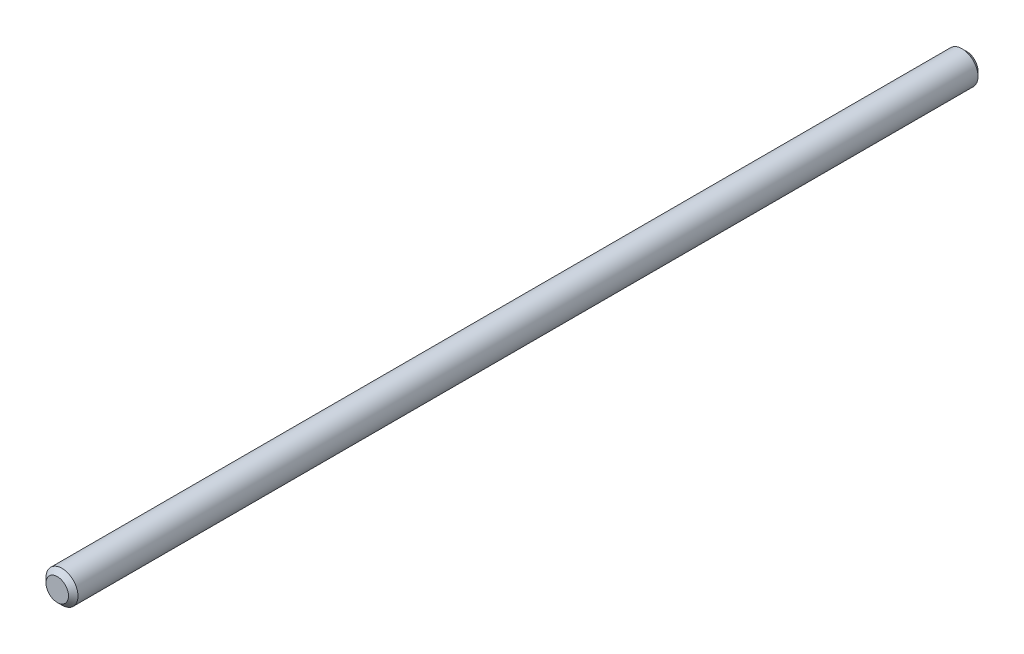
from build123d import *

# Parameters (mm, degrees)
SKETCH1_W     = 304.8
SKETCH1_H     = 5.35813
CHAMFER1_SIZE = 1.5875


with BuildPart() as part:
    # Sketch1 → Revolve1 (revolve)
    with BuildSketch(Plane(origin=(0, 0, 0), x_dir=(0, 0, -1), z_dir=(1, 0, 0)), mode=Mode.PRIVATE) as revolve1_sk:
        with Locations((-152.4, 2.679065)):
            Rectangle(SKETCH1_W, SKETCH1_H)
    revolve(revolve1_sk.sketch.rotate(Axis((0, 0, 0), (0, 0, -1)), 90), axis=Axis((0, 0, 0), (0, 0, -1)))

    # Chamfer1
    chamfer1_edges = [part.edges().sort_by_distance(p)[0] for p in [
        (-5.35813, 0, 304.8),
        (-5.35813, 0, 0),
    ]]
    chamfer(chamfer1_edges, length=CHAMFER1_SIZE)


solid = part.part
